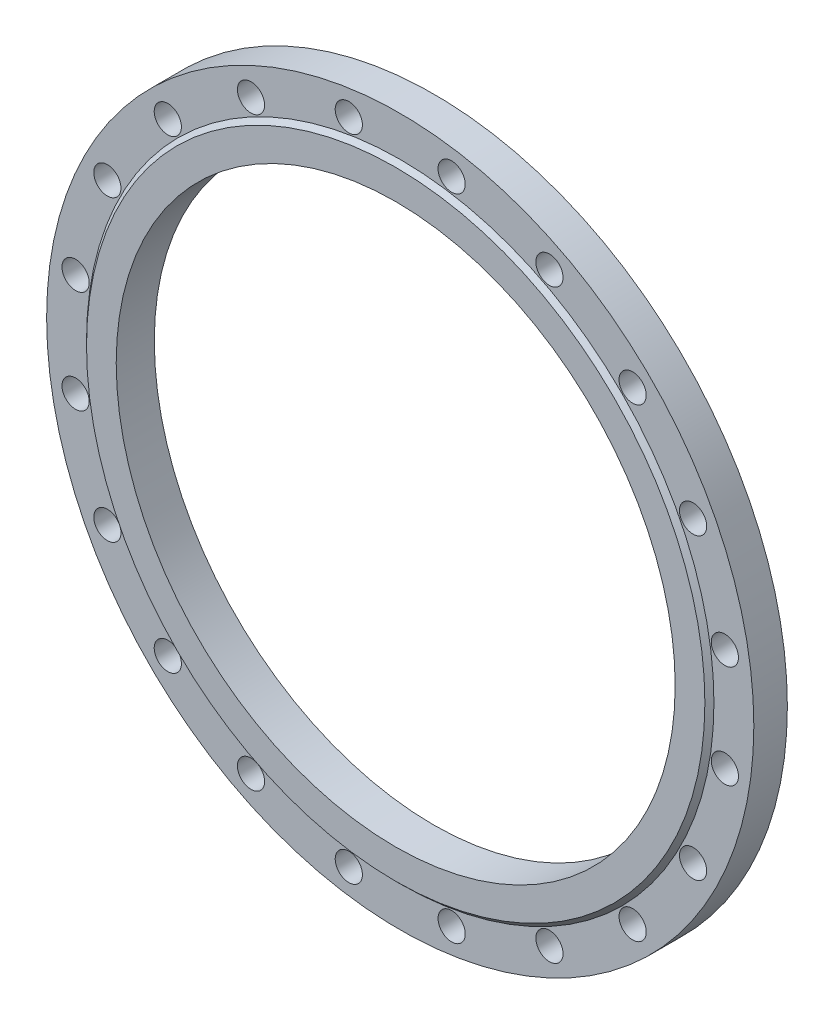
from build123d import *

# Parameters (mm, degrees)
ESQUISSE4_R             = 15
ENL_V_MAT_EXTRU_1_DEPTH = 553.782959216


with BuildPart() as part:
    # Esquisse3 → R_volution1 (revolve)
    with BuildSketch(Plane(origin=(0, 0, 0), x_dir=(0, 0, -1), z_dir=(1, 0, 0)), mode=Mode.PRIVATE) as r_volution1_sk:
        Polygon((-24, 390), (13, 390), (13, 308.25), (-29, 308.25), (-29, 341), (-24, 346), align=None)
    revolve(r_volution1_sk.sketch.rotate(Axis((0, 0, 0), (0, 0, 1)), 90), axis=Axis((0, 0, 0), (0, 0, 1)))

    # Esquisse4 → Enl_v. mat.-Extru.1 (cut, through all)
    with BuildSketch(Plane.XY.offset(24)):
        with Locations((358.037023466, 56.707493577)):
            Circle(ESQUISSE4_R)
        with Locations((358.037023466, -56.707493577)):
            Circle(ESQUISSE4_R)
        with Locations((322.989865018, -164.571556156)):
            Circle(ESQUISSE4_R)
        with Locations((256.32620818, -256.32620818)):
            Circle(ESQUISSE4_R)
        with Locations((164.571556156, -322.989865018)):
            Circle(ESQUISSE4_R)
        with Locations((56.707493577, -358.037023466)):
            Circle(ESQUISSE4_R)
        with Locations((-56.707493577, -358.037023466)):
            Circle(ESQUISSE4_R)
        with Locations((-164.571556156, -322.989865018)):
            Circle(ESQUISSE4_R)
        with Locations((-256.32620818, -256.32620818)):
            Circle(ESQUISSE4_R)
        with Locations((-322.989865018, -164.571556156)):
            Circle(ESQUISSE4_R)
        with Locations((-358.037023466, -56.707493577)):
            Circle(ESQUISSE4_R)
        with Locations((-358.037023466, 56.707493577)):
            Circle(ESQUISSE4_R)
        with Locations((-322.989865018, 164.571556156)):
            Circle(ESQUISSE4_R)
        with Locations((-256.32620818, 256.32620818)):
            Circle(ESQUISSE4_R)
        with Locations((-164.571556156, 322.989865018)):
            Circle(ESQUISSE4_R)
        with Locations((-56.707493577, 358.037023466)):
            Circle(ESQUISSE4_R)
        with Locations((56.707493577, 358.037023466)):
            Circle(ESQUISSE4_R)
        with Locations((164.571556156, 322.989865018)):
            Circle(ESQUISSE4_R)
        with Locations((256.32620818, 256.32620818)):
            Circle(ESQUISSE4_R)
        with Locations((322.989865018, 164.571556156)):
            Circle(ESQUISSE4_R)
    extrude(amount=-ENL_V_MAT_EXTRU_1_DEPTH, mode=Mode.SUBTRACT)


solid = part.part
